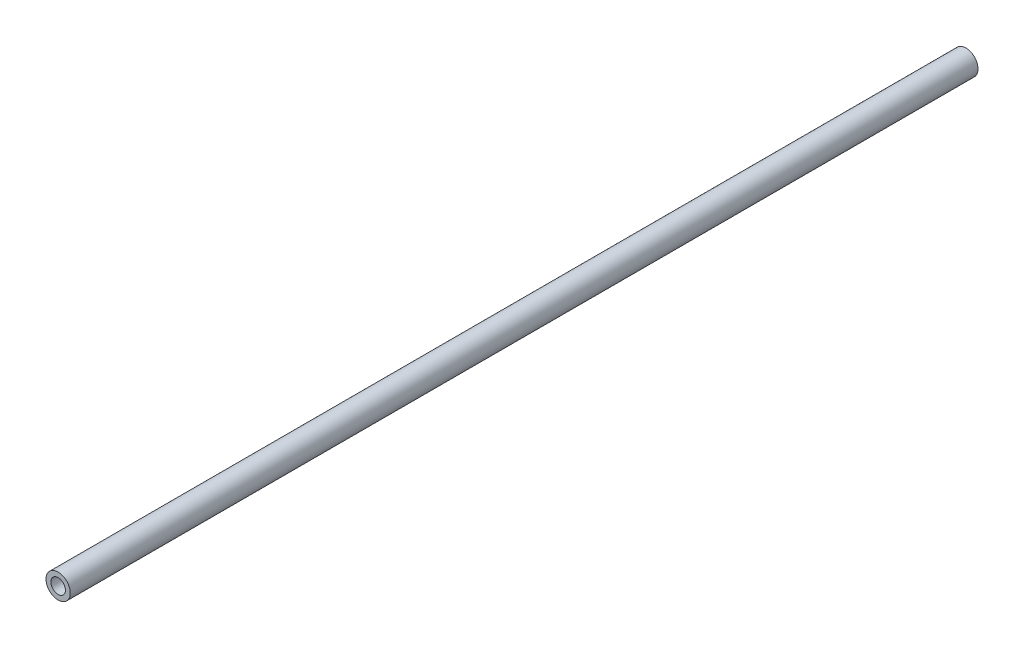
from build123d import *

# Parameters (mm, degrees)
SKETCH1_R      = 6.35
SKETCH1_R_2    = 3.81
EXTRUDE1_DEPTH = 474.98


with BuildPart() as part:
    # Sketch1 → Extrude1 (new body)
    with BuildSketch(Plane.XY):
        with Locations(Location((0, 0, 0), (0, 0, 180))):
            Circle(SKETCH1_R)
        with Locations(Location((0, 0, 0), (0, 0, 180))):
            Circle(SKETCH1_R_2, mode=Mode.SUBTRACT)
    extrude(amount=EXTRUDE1_DEPTH)


solid = part.part
